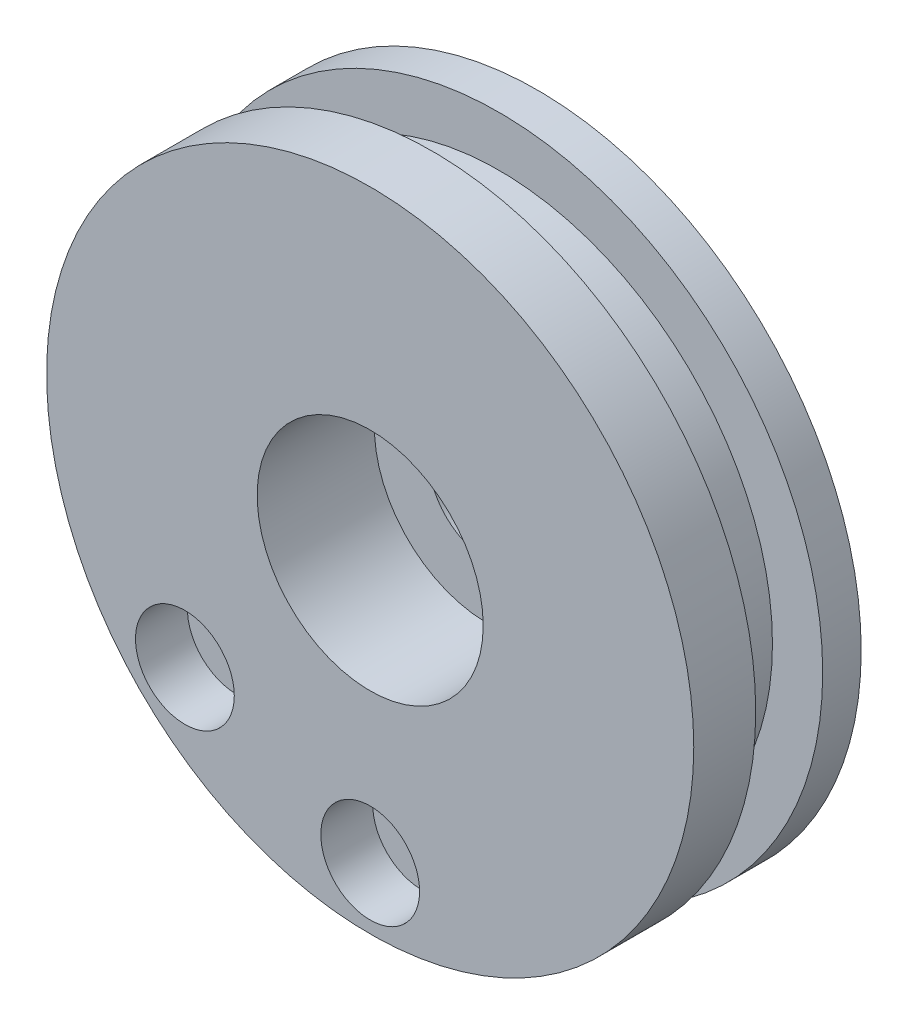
ISO-10303-21;
HEADER;
FILE_DESCRIPTION(('STEP AP214'),'2;1');
FILE_NAME('part.step','',(''),(''),'','','');
FILE_SCHEMA(('AUTOMOTIVE_DESIGN { 1 0 10303 214 1 1 1 1 }'));
ENDSEC;
DATA;
#1=APPLICATION_CONTEXT('core data for automotive mechanical design processes');
#2=APPLICATION_PROTOCOL_DEFINITION('international standard','automotive_design',2000,#1);
#3=PRODUCT_CONTEXT('',#1,'mechanical');
#4=PRODUCT('Part','Part','',(#3));
#5=PRODUCT_RELATED_PRODUCT_CATEGORY('part','',(#4));
#6=PRODUCT_DEFINITION_FORMATION('','',#4);
#7=PRODUCT_DEFINITION_CONTEXT('part definition',#1,'design');
#8=PRODUCT_DEFINITION('design','',#6,#7);
#9=PRODUCT_DEFINITION_SHAPE('','',#8);
#10=(LENGTH_UNIT() NAMED_UNIT(*) SI_UNIT(.MILLI.,.METRE.));
#11=(NAMED_UNIT(*) PLANE_ANGLE_UNIT() SI_UNIT($,.RADIAN.));
#12=(NAMED_UNIT(*) SI_UNIT($,.STERADIAN.) SOLID_ANGLE_UNIT());
#13=UNCERTAINTY_MEASURE_WITH_UNIT(LENGTH_MEASURE(1.E-05),#10,'distance_accuracy_value','');
#14=(GEOMETRIC_REPRESENTATION_CONTEXT(3) GLOBAL_UNCERTAINTY_ASSIGNED_CONTEXT((#13)) GLOBAL_UNIT_ASSIGNED_CONTEXT((#10,
#11,#12)) REPRESENTATION_CONTEXT('',''));
#15=CARTESIAN_POINT('',(0.,0.,0.));
#16=DIRECTION('',(0.,0.,1.));
#17=DIRECTION('',(1.,0.,0.));
#18=AXIS2_PLACEMENT_3D('',#15,#16,#17);
#19=CARTESIAN_POINT('',(0.,0.,0.));
#20=DIRECTION('',(0.,0.,1.));
#21=DIRECTION('',(1.,0.,0.));
#22=AXIS2_PLACEMENT_3D('',#19,#20,#21);
#23=CYLINDRICAL_SURFACE('',#22,1.778);
#24=CARTESIAN_POINT('',(0.,0.,1.524));
#25=DIRECTION('',(0.,0.,1.));
#26=DIRECTION('',(1.,0.,0.));
#27=AXIS2_PLACEMENT_3D('',#24,#25,#26);
#28=CIRCLE('',#27,1.778);
#29=CARTESIAN_POINT('',(1.778,0.,1.524));
#30=VERTEX_POINT('',#29);
#31=EDGE_CURVE('E47',#30,#30,#28,.F.);
#32=ORIENTED_EDGE('',*,*,#31,.F.);
#33=EDGE_LOOP('',(#32));
#34=FACE_BOUND('',#33,.T.);
#35=CARTESIAN_POINT('',(0.,0.,0.635));
#36=DIRECTION('',(0.,0.,-1.));
#37=DIRECTION('',(-1.,0.,0.));
#38=AXIS2_PLACEMENT_3D('',#35,#36,#37);
#39=CIRCLE('',#38,1.778);
#40=CARTESIAN_POINT('',(-1.778,0.,0.635));
#41=VERTEX_POINT('',#40);
#42=EDGE_CURVE('E38',#41,#41,#39,.F.);
#43=ORIENTED_EDGE('',*,*,#42,.F.);
#44=EDGE_LOOP('',(#43));
#45=FACE_BOUND('',#44,.T.);
#46=ADVANCED_FACE('F34',(#34,#45),#23,.F.);
#47=CARTESIAN_POINT('',(0.,0.,5.08));
#48=DIRECTION('',(0.,0.,-1.));
#49=DIRECTION('',(-1.,0.,0.));
#50=AXIS2_PLACEMENT_3D('',#47,#48,#49);
#51=CYLINDRICAL_SURFACE('',#50,9.8171);
#52=CARTESIAN_POINT('',(0.,0.,0.));
#53=DIRECTION('',(0.,0.,1.));
#54=DIRECTION('',(1.,0.,0.));
#55=AXIS2_PLACEMENT_3D('',#52,#53,#54);
#56=CIRCLE('',#55,9.8171);
#57=CARTESIAN_POINT('',(9.8171,0.,0.));
#58=VERTEX_POINT('',#57);
#59=EDGE_CURVE('E42',#58,#58,#56,.T.);
#60=ORIENTED_EDGE('',*,*,#59,.T.);
#61=EDGE_LOOP('',(#60));
#62=FACE_BOUND('',#61,.T.);
#63=CARTESIAN_POINT('',(0.,0.,1.1684));
#64=DIRECTION('',(0.,0.,1.));
#65=DIRECTION('',(1.,0.,0.));
#66=AXIS2_PLACEMENT_3D('',#63,#64,#65);
#67=CIRCLE('',#66,9.8171);
#68=CARTESIAN_POINT('',(9.8171,0.,1.1684));
#69=VERTEX_POINT('',#68);
#70=EDGE_CURVE('E58',#69,#69,#67,.T.);
#71=ORIENTED_EDGE('',*,*,#70,.F.);
#72=EDGE_LOOP('',(#71));
#73=FACE_BOUND('',#72,.T.);
#74=ADVANCED_FACE('F97',(#62,#73),#51,.T.);
#75=CARTESIAN_POINT('',(0.,0.,3.2004));
#76=DIRECTION('',(0.,0.,1.));
#77=DIRECTION('',(1.,0.,0.));
#78=AXIS2_PLACEMENT_3D('',#75,#76,#77);
#79=CIRCLE('',#78,9.8171);
#80=CARTESIAN_POINT('',(9.8171,0.,3.2004));
#81=VERTEX_POINT('',#80);
#82=EDGE_CURVE('E56',#81,#81,#79,.T.);
#83=ORIENTED_EDGE('',*,*,#82,.T.);
#84=EDGE_LOOP('',(#83));
#85=FACE_BOUND('',#84,.T.);
#86=CARTESIAN_POINT('',(0.,0.,5.08));
#87=DIRECTION('',(0.,0.,1.));
#88=DIRECTION('',(1.,0.,0.));
#89=AXIS2_PLACEMENT_3D('',#86,#87,#88);
#90=CIRCLE('',#89,9.8171);
#91=CARTESIAN_POINT('',(9.8171,0.,5.08));
#92=VERTEX_POINT('',#91);
#93=EDGE_CURVE('E11',#92,#92,#90,.T.);
#94=ORIENTED_EDGE('',*,*,#93,.F.);
#95=EDGE_LOOP('',(#94));
#96=FACE_BOUND('',#95,.T.);
#97=ADVANCED_FACE('F36',(#85,#96),#51,.T.);
#98=CARTESIAN_POINT('',(0.,0.,5.08));
#99=DIRECTION('',(0.,0.,1.));
#100=DIRECTION('',(1.,0.,0.));
#101=AXIS2_PLACEMENT_3D('',#98,#99,#100);
#102=PLANE('',#101);
#103=CARTESIAN_POINT('',(-5.6216403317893,-5.62164033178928,5.08));
#104=DIRECTION('',(0.,0.,1.));
#105=DIRECTION('',(1.,0.,0.));
#106=AXIS2_PLACEMENT_3D('',#103,#104,#105);
#107=CIRCLE('',#106,1.4986);
#108=CARTESIAN_POINT('',(-4.1230403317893,-5.62164033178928,5.08));
#109=VERTEX_POINT('',#108);
#110=EDGE_CURVE('E61',#109,#109,#107,.T.);
#111=ORIENTED_EDGE('',*,*,#110,.F.);
#112=EDGE_LOOP('',(#111));
#113=FACE_BOUND('',#112,.T.);
#114=CARTESIAN_POINT('',(0.,-7.9502,5.08));
#115=DIRECTION('',(0.,0.,1.));
#116=DIRECTION('',(1.,0.,0.));
#117=AXIS2_PLACEMENT_3D('',#114,#115,#116);
#118=CIRCLE('',#117,1.4986);
#119=CARTESIAN_POINT('',(1.4986,-7.9502,5.08));
#120=VERTEX_POINT('',#119);
#121=EDGE_CURVE('E70',#120,#120,#118,.T.);
#122=ORIENTED_EDGE('',*,*,#121,.F.);
#123=EDGE_LOOP('',(#122));
#124=FACE_BOUND('',#123,.T.);
#125=CARTESIAN_POINT('',(0.,0.,5.08));
#126=DIRECTION('',(0.,0.,1.));
#127=DIRECTION('',(1.,0.,0.));
#128=AXIS2_PLACEMENT_3D('',#125,#126,#127);
#129=CIRCLE('',#128,3.429);
#130=CARTESIAN_POINT('',(3.429,0.,5.08));
#131=VERTEX_POINT('',#130);
#132=EDGE_CURVE('E50',#131,#131,#129,.T.);
#133=ORIENTED_EDGE('',*,*,#132,.F.);
#134=EDGE_LOOP('',(#133));
#135=FACE_BOUND('',#134,.T.);
#136=ORIENTED_EDGE('',*,*,#93,.T.);
#137=EDGE_LOOP('',(#136));
#138=FACE_BOUND('',#137,.T.);
#139=ADVANCED_FACE('F86',(#113,#124,#135,#138),#102,.T.);
#140=CARTESIAN_POINT('',(0.,0.,0.));
#141=DIRECTION('',(0.,0.,1.));
#142=DIRECTION('',(1.,0.,0.));
#143=AXIS2_PLACEMENT_3D('',#140,#141,#142);
#144=PLANE('',#143);
#145=CARTESIAN_POINT('',(0.,0.,0.));
#146=DIRECTION('',(0.,0.,-1.));
#147=DIRECTION('',(-1.,0.,0.));
#148=AXIS2_PLACEMENT_3D('',#145,#146,#147);
#149=CIRCLE('',#148,3.1877);
#150=CARTESIAN_POINT('',(-3.1877,0.,0.));
#151=VERTEX_POINT('',#150);
#152=EDGE_CURVE('E160',#151,#151,#149,.T.);
#153=ORIENTED_EDGE('',*,*,#152,.F.);
#154=EDGE_LOOP('',(#153));
#155=FACE_BOUND('',#154,.T.);
#156=ORIENTED_EDGE('',*,*,#59,.F.);
#157=EDGE_LOOP('',(#156));
#158=FACE_BOUND('',#157,.T.);
#159=ADVANCED_FACE('F88',(#155,#158),#144,.F.);
#160=CARTESIAN_POINT('',(0.,0.,1.524));
#161=DIRECTION('',(0.,0.,1.));
#162=DIRECTION('',(1.,0.,0.));
#163=AXIS2_PLACEMENT_3D('',#160,#161,#162);
#164=PLANE('',#163);
#165=CARTESIAN_POINT('',(0.,0.,1.524));
#166=DIRECTION('',(0.,0.,1.));
#167=DIRECTION('',(1.,0.,0.));
#168=AXIS2_PLACEMENT_3D('',#165,#166,#167);
#169=CIRCLE('',#168,3.429);
#170=CARTESIAN_POINT('',(3.429,0.,1.524));
#171=VERTEX_POINT('',#170);
#172=EDGE_CURVE('E55',#171,#171,#169,.T.);
#173=ORIENTED_EDGE('',*,*,#172,.T.);
#174=EDGE_LOOP('',(#173));
#175=FACE_BOUND('',#174,.T.);
#176=ORIENTED_EDGE('',*,*,#31,.T.);
#177=EDGE_LOOP('',(#176));
#178=FACE_BOUND('',#177,.T.);
#179=ADVANCED_FACE('F95',(#175,#178),#164,.T.);
#180=CARTESIAN_POINT('',(0.,0.,1.524));
#181=DIRECTION('',(0.,0.,1.));
#182=DIRECTION('',(1.,0.,0.));
#183=AXIS2_PLACEMENT_3D('',#180,#181,#182);
#184=CYLINDRICAL_SURFACE('',#183,3.429);
#185=ORIENTED_EDGE('',*,*,#172,.F.);
#186=EDGE_LOOP('',(#185));
#187=FACE_BOUND('',#186,.T.);
#188=ORIENTED_EDGE('',*,*,#132,.T.);
#189=EDGE_LOOP('',(#188));
#190=FACE_BOUND('',#189,.T.);
#191=ADVANCED_FACE('F84',(#187,#190),#184,.F.);
#192=CARTESIAN_POINT('',(0.,-7.9502,3.5052));
#193=DIRECTION('',(0.,0.,1.));
#194=DIRECTION('',(1.,0.,0.));
#195=AXIS2_PLACEMENT_3D('',#192,#193,#194);
#196=CYLINDRICAL_SURFACE('',#195,1.4986);
#197=CARTESIAN_POINT('',(0.,-7.9502,3.5052));
#198=DIRECTION('',(0.,0.,1.));
#199=DIRECTION('',(1.,0.,0.));
#200=AXIS2_PLACEMENT_3D('',#197,#198,#199);
#201=CIRCLE('',#200,1.4986);
#202=CARTESIAN_POINT('',(1.4986,-7.9502,3.5052));
#203=VERTEX_POINT('',#202);
#204=EDGE_CURVE('E74',#203,#203,#201,.T.);
#205=ORIENTED_EDGE('',*,*,#204,.F.);
#206=EDGE_LOOP('',(#205));
#207=FACE_BOUND('',#206,.T.);
#208=ORIENTED_EDGE('',*,*,#121,.T.);
#209=EDGE_LOOP('',(#208));
#210=FACE_BOUND('',#209,.T.);
#211=ADVANCED_FACE('F112',(#207,#210),#196,.F.);
#212=CARTESIAN_POINT('',(0.,-7.9502,3.5052));
#213=DIRECTION('',(0.,0.,1.));
#214=DIRECTION('',(1.,0.,0.));
#215=AXIS2_PLACEMENT_3D('',#212,#213,#214);
#216=PLANE('',#215);
#217=ORIENTED_EDGE('',*,*,#204,.T.);
#218=EDGE_LOOP('',(#217));
#219=FACE_BOUND('',#218,.T.);
#220=ADVANCED_FACE('F118',(#219),#216,.T.);
#221=CARTESIAN_POINT('',(-5.6216403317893,-5.62164033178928,3.5052));
#222=DIRECTION('',(0.,0.,1.));
#223=DIRECTION('',(1.,0.,0.));
#224=AXIS2_PLACEMENT_3D('',#221,#222,#223);
#225=CYLINDRICAL_SURFACE('',#224,1.4986);
#226=CARTESIAN_POINT('',(-5.6216403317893,-5.62164033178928,3.5052));
#227=DIRECTION('',(0.,0.,1.));
#228=DIRECTION('',(1.,0.,0.));
#229=AXIS2_PLACEMENT_3D('',#226,#227,#228);
#230=CIRCLE('',#229,1.4986);
#231=CARTESIAN_POINT('',(-4.1230403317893,-5.62164033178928,3.5052));
#232=VERTEX_POINT('',#231);
#233=EDGE_CURVE('E65',#232,#232,#230,.T.);
#234=ORIENTED_EDGE('',*,*,#233,.F.);
#235=EDGE_LOOP('',(#234));
#236=FACE_BOUND('',#235,.T.);
#237=ORIENTED_EDGE('',*,*,#110,.T.);
#238=EDGE_LOOP('',(#237));
#239=FACE_BOUND('',#238,.T.);
#240=ADVANCED_FACE('F122',(#236,#239),#225,.F.);
#241=CARTESIAN_POINT('',(-5.6216403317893,-5.62164033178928,3.5052));
#242=DIRECTION('',(0.,0.,1.));
#243=DIRECTION('',(1.,0.,0.));
#244=AXIS2_PLACEMENT_3D('',#241,#242,#243);
#245=PLANE('',#244);
#246=ORIENTED_EDGE('',*,*,#233,.T.);
#247=EDGE_LOOP('',(#246));
#248=FACE_BOUND('',#247,.T.);
#249=ADVANCED_FACE('F126',(#248),#245,.T.);
#250=CARTESIAN_POINT('',(0.,0.,1.1684));
#251=DIRECTION('',(0.,0.,1.));
#252=DIRECTION('',(1.,0.,0.));
#253=AXIS2_PLACEMENT_3D('',#250,#251,#252);
#254=PLANE('',#253);
#255=CARTESIAN_POINT('',(0.,0.,1.1684));
#256=DIRECTION('',(0.,0.,1.));
#257=DIRECTION('',(1.,0.,0.));
#258=AXIS2_PLACEMENT_3D('',#255,#256,#257);
#259=CIRCLE('',#258,8.2931);
#260=CARTESIAN_POINT('',(8.2931,0.,1.1684));
#261=VERTEX_POINT('',#260);
#262=EDGE_CURVE('E59',#261,#261,#259,.T.);
#263=ORIENTED_EDGE('',*,*,#262,.F.);
#264=EDGE_LOOP('',(#263));
#265=FACE_BOUND('',#264,.T.);
#266=ORIENTED_EDGE('',*,*,#70,.T.);
#267=EDGE_LOOP('',(#266));
#268=FACE_BOUND('',#267,.T.);
#269=ADVANCED_FACE('F130',(#265,#268),#254,.T.);
#270=CARTESIAN_POINT('',(0.,0.,3.2004));
#271=DIRECTION('',(0.,0.,1.));
#272=DIRECTION('',(1.,0.,0.));
#273=AXIS2_PLACEMENT_3D('',#270,#271,#272);
#274=PLANE('',#273);
#275=CARTESIAN_POINT('',(0.,0.,3.2004));
#276=DIRECTION('',(0.,0.,1.));
#277=DIRECTION('',(1.,0.,0.));
#278=AXIS2_PLACEMENT_3D('',#275,#276,#277);
#279=CIRCLE('',#278,8.2931);
#280=CARTESIAN_POINT('',(8.2931,0.,3.2004));
#281=VERTEX_POINT('',#280);
#282=EDGE_CURVE('E158',#281,#281,#279,.T.);
#283=ORIENTED_EDGE('',*,*,#282,.T.);
#284=EDGE_LOOP('',(#283));
#285=FACE_BOUND('',#284,.T.);
#286=ORIENTED_EDGE('',*,*,#82,.F.);
#287=EDGE_LOOP('',(#286));
#288=FACE_BOUND('',#287,.T.);
#289=ADVANCED_FACE('F132',(#285,#288),#274,.F.);
#290=CARTESIAN_POINT('',(0.,0.,1.1684));
#291=DIRECTION('',(0.,0.,1.));
#292=DIRECTION('',(1.,0.,0.));
#293=AXIS2_PLACEMENT_3D('',#290,#291,#292);
#294=CYLINDRICAL_SURFACE('',#293,8.2931);
#295=ORIENTED_EDGE('',*,*,#262,.T.);
#296=EDGE_LOOP('',(#295));
#297=FACE_BOUND('',#296,.T.);
#298=ORIENTED_EDGE('',*,*,#282,.F.);
#299=EDGE_LOOP('',(#298));
#300=FACE_BOUND('',#299,.T.);
#301=ADVANCED_FACE('F135',(#297,#300),#294,.T.);
#302=CARTESIAN_POINT('',(0.,0.,0.635));
#303=DIRECTION('',(0.,0.,-1.));
#304=DIRECTION('',(-1.,0.,0.));
#305=AXIS2_PLACEMENT_3D('',#302,#303,#304);
#306=PLANE('',#305);
#307=CARTESIAN_POINT('',(0.,0.,0.635));
#308=DIRECTION('',(0.,0.,-1.));
#309=DIRECTION('',(-1.,0.,0.));
#310=AXIS2_PLACEMENT_3D('',#307,#308,#309);
#311=CIRCLE('',#310,3.1877);
#312=CARTESIAN_POINT('',(-3.1877,0.,0.635));
#313=VERTEX_POINT('',#312);
#314=EDGE_CURVE('E155',#313,#313,#311,.T.);
#315=ORIENTED_EDGE('',*,*,#314,.T.);
#316=EDGE_LOOP('',(#315));
#317=FACE_BOUND('',#316,.T.);
#318=ORIENTED_EDGE('',*,*,#42,.T.);
#319=EDGE_LOOP('',(#318));
#320=FACE_BOUND('',#319,.T.);
#321=ADVANCED_FACE('F142',(#317,#320),#306,.T.);
#322=CARTESIAN_POINT('',(0.,0.,0.635));
#323=DIRECTION('',(0.,0.,-1.));
#324=DIRECTION('',(-1.,0.,0.));
#325=AXIS2_PLACEMENT_3D('',#322,#323,#324);
#326=CYLINDRICAL_SURFACE('',#325,3.1877);
#327=ORIENTED_EDGE('',*,*,#314,.F.);
#328=EDGE_LOOP('',(#327));
#329=FACE_BOUND('',#328,.T.);
#330=ORIENTED_EDGE('',*,*,#152,.T.);
#331=EDGE_LOOP('',(#330));
#332=FACE_BOUND('',#331,.T.);
#333=ADVANCED_FACE('F144',(#329,#332),#326,.F.);
#334=CLOSED_SHELL('',(#46,#74,#97,#139,#159,#179,#191,#211,#220,#240,#249,#269,#289,#301,#321,#333));
#335=MANIFOLD_SOLID_BREP('B2',#334);
#336=ADVANCED_BREP_SHAPE_REPRESENTATION('',(#18,#335),#14);
#337=SHAPE_DEFINITION_REPRESENTATION(#9,#336);
ENDSEC;
END-ISO-10303-21;
